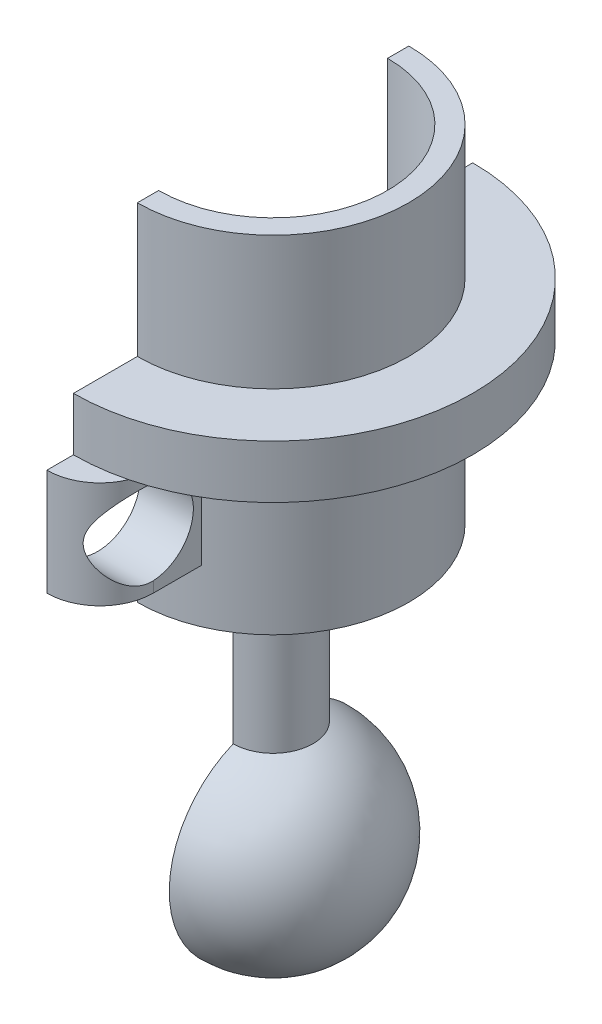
ISO-10303-21;
HEADER;
FILE_DESCRIPTION(('STEP AP214'),'2;1');
FILE_NAME('part.step','',(''),(''),'','','');
FILE_SCHEMA(('AUTOMOTIVE_DESIGN { 1 0 10303 214 1 1 1 1 }'));
ENDSEC;
DATA;
#1=APPLICATION_CONTEXT('core data for automotive mechanical design processes');
#2=APPLICATION_PROTOCOL_DEFINITION('international standard','automotive_design',2000,#1);
#3=PRODUCT_CONTEXT('',#1,'mechanical');
#4=PRODUCT('Part','Part','',(#3));
#5=PRODUCT_RELATED_PRODUCT_CATEGORY('part','',(#4));
#6=PRODUCT_DEFINITION_FORMATION('','',#4);
#7=PRODUCT_DEFINITION_CONTEXT('part definition',#1,'design');
#8=PRODUCT_DEFINITION('design','',#6,#7);
#9=PRODUCT_DEFINITION_SHAPE('','',#8);
#10=(LENGTH_UNIT() NAMED_UNIT(*) SI_UNIT(.MILLI.,.METRE.));
#11=(NAMED_UNIT(*) PLANE_ANGLE_UNIT() SI_UNIT($,.RADIAN.));
#12=(NAMED_UNIT(*) SI_UNIT($,.STERADIAN.) SOLID_ANGLE_UNIT());
#13=UNCERTAINTY_MEASURE_WITH_UNIT(LENGTH_MEASURE(1.E-05),#10,'distance_accuracy_value','');
#14=(GEOMETRIC_REPRESENTATION_CONTEXT(3) GLOBAL_UNCERTAINTY_ASSIGNED_CONTEXT((#13)) GLOBAL_UNIT_ASSIGNED_CONTEXT((#10,
#11,#12)) REPRESENTATION_CONTEXT('',''));
#15=CARTESIAN_POINT('',(0.,0.,0.));
#16=DIRECTION('',(0.,0.,1.));
#17=DIRECTION('',(1.,0.,0.));
#18=AXIS2_PLACEMENT_3D('',#15,#16,#17);
#19=CARTESIAN_POINT('',(0.,0.,0.));
#20=DIRECTION('',(1.,0.,0.));
#21=DIRECTION('',(0.,0.,-1.));
#22=AXIS2_PLACEMENT_3D('',#19,#20,#21);
#23=PLANE('',#22);
#24=DIRECTION('',(0.,0.,-1.));
#25=VECTOR('',#24,1.);
#26=CARTESIAN_POINT('',(0.,1.,0.));
#27=LINE('',#26,#25);
#28=CARTESIAN_POINT('',(0.,1.,2.5));
#29=VERTEX_POINT('',#28);
#30=CARTESIAN_POINT('',(0.,1.,-2.5));
#31=VERTEX_POINT('',#30);
#32=EDGE_CURVE('E493',#29,#31,#27,.T.);
#33=ORIENTED_EDGE('',*,*,#32,.T.);
#34=DIRECTION('',(0.,1.,0.));
#35=VECTOR('',#34,1.);
#36=CARTESIAN_POINT('',(0.,0.,-2.5));
#37=LINE('',#36,#35);
#38=CARTESIAN_POINT('',(0.,0.,-2.5));
#39=VERTEX_POINT('',#38);
#40=EDGE_CURVE('E554',#31,#39,#37,.F.);
#41=ORIENTED_EDGE('',*,*,#40,.T.);
#42=DIRECTION('',(0.,0.,-1.));
#43=VECTOR('',#42,1.);
#44=CARTESIAN_POINT('',(0.,0.,0.));
#45=LINE('',#44,#43);
#46=CARTESIAN_POINT('',(0.,0.,-1.5));
#47=VERTEX_POINT('',#46);
#48=EDGE_CURVE('E851',#47,#39,#45,.T.);
#49=ORIENTED_EDGE('',*,*,#48,.F.);
#50=DIRECTION('',(0.,1.,0.));
#51=VECTOR('',#50,1.);
#52=CARTESIAN_POINT('',(0.,0.,-1.5));
#53=LINE('',#52,#51);
#54=CARTESIAN_POINT('',(0.,-6.4,-1.5));
#55=VERTEX_POINT('',#54);
#56=EDGE_CURVE('E550',#47,#55,#53,.F.);
#57=ORIENTED_EDGE('',*,*,#56,.T.);
#58=CARTESIAN_POINT('',(0.,-10.,0.));
#59=DIRECTION('',(1.,0.,0.));
#60=DIRECTION('',(0.,0.,-1.));
#61=AXIS2_PLACEMENT_3D('',#58,#59,#60);
#62=CIRCLE('',#61,3.9);
#63=CARTESIAN_POINT('',(0.,-6.4,1.5));
#64=VERTEX_POINT('',#63);
#65=EDGE_CURVE('E530',#55,#64,#62,.F.);
#66=ORIENTED_EDGE('',*,*,#65,.T.);
#67=DIRECTION('',(0.,1.,0.));
#68=VECTOR('',#67,1.);
#69=CARTESIAN_POINT('',(0.,0.,1.5));
#70=LINE('',#69,#68);
#71=CARTESIAN_POINT('',(0.,0.,1.5));
#72=VERTEX_POINT('',#71);
#73=EDGE_CURVE('E546',#64,#72,#70,.T.);
#74=ORIENTED_EDGE('',*,*,#73,.T.);
#75=CARTESIAN_POINT('',(0.,0.,2.5));
#76=VERTEX_POINT('',#75);
#77=EDGE_CURVE('E518',#76,#72,#45,.T.);
#78=ORIENTED_EDGE('',*,*,#77,.F.);
#79=DIRECTION('',(0.,1.,0.));
#80=VECTOR('',#79,1.);
#81=CARTESIAN_POINT('',(0.,0.,2.5));
#82=LINE('',#81,#80);
#83=EDGE_CURVE('E50',#76,#29,#82,.T.);
#84=ORIENTED_EDGE('',*,*,#83,.T.);
#85=EDGE_LOOP('',(#33,#41,#49,#57,#66,#74,#78,#84));
#86=FACE_BOUND('',#85,.T.);
#87=ADVANCED_FACE('F47',(#86),#23,.F.);
#88=CARTESIAN_POINT('',(0.,4.,6.59574082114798));
#89=DIRECTION('',(1.,0.,0.));
#90=DIRECTION('',(0.,1.,0.));
#91=AXIS2_PLACEMENT_3D('',#88,#89,#90);
#92=CIRCLE('',#91,1.6);
#93=CARTESIAN_POINT('',(0.,5.6,6.59574082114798));
#94=VERTEX_POINT('',#93);
#95=EDGE_CURVE('E526',#94,#94,#92,.T.);
#96=ORIENTED_EDGE('',*,*,#95,.T.);
#97=EDGE_LOOP('',(#96));
#98=FACE_BOUND('',#97,.T.);
#99=CARTESIAN_POINT('',(0.,0.,5.1));
#100=VERTEX_POINT('',#99);
#101=CARTESIAN_POINT('',(0.,0.,3.3));
#102=VERTEX_POINT('',#101);
#103=EDGE_CURVE('E513',#100,#102,#45,.T.);
#104=ORIENTED_EDGE('',*,*,#103,.F.);
#105=DIRECTION('',(0.,-1.,0.));
#106=VECTOR('',#105,1.);
#107=CARTESIAN_POINT('',(0.,1.,5.1));
#108=LINE('',#107,#106);
#109=CARTESIAN_POINT('',(0.,2.,5.1));
#110=VERTEX_POINT('',#109);
#111=EDGE_CURVE('E538',#110,#100,#108,.T.);
#112=ORIENTED_EDGE('',*,*,#111,.F.);
#113=DIRECTION('',(0.,0.,1.));
#114=VECTOR('',#113,1.);
#115=CARTESIAN_POINT('',(0.,2.,-7.502));
#116=LINE('',#115,#114);
#117=CARTESIAN_POINT('',(0.,2.,8.5));
#118=VERTEX_POINT('',#117);
#119=EDGE_CURVE('E527',#110,#118,#116,.T.);
#120=ORIENTED_EDGE('',*,*,#119,.T.);
#121=DIRECTION('',(0.,1.,0.));
#122=VECTOR('',#121,1.);
#123=CARTESIAN_POINT('',(0.,6.,8.5));
#124=LINE('',#123,#122);
#125=CARTESIAN_POINT('',(0.,6.,8.5));
#126=VERTEX_POINT('',#125);
#127=EDGE_CURVE('E56',#118,#126,#124,.T.);
#128=ORIENTED_EDGE('',*,*,#127,.T.);
#129=DIRECTION('',(0.,0.,-1.));
#130=VECTOR('',#129,1.);
#131=CARTESIAN_POINT('',(0.,6.,-7.502));
#132=LINE('',#131,#130);
#133=CARTESIAN_POINT('',(0.,6.,7.5));
#134=VERTEX_POINT('',#133);
#135=EDGE_CURVE('E71',#126,#134,#132,.T.);
#136=ORIENTED_EDGE('',*,*,#135,.T.);
#137=DIRECTION('',(0.,-1.,0.));
#138=VECTOR('',#137,1.);
#139=CARTESIAN_POINT('',(0.,8.,7.5));
#140=LINE('',#139,#138);
#141=CARTESIAN_POINT('',(0.,8.,7.5));
#142=VERTEX_POINT('',#141);
#143=EDGE_CURVE('E523',#142,#134,#140,.T.);
#144=ORIENTED_EDGE('',*,*,#143,.F.);
#145=DIRECTION('',(0.,0.,-1.));
#146=VECTOR('',#145,1.);
#147=CARTESIAN_POINT('',(0.,8.,0.));
#148=LINE('',#147,#146);
#149=CARTESIAN_POINT('',(0.,8.,5.1));
#150=VERTEX_POINT('',#149);
#151=EDGE_CURVE('E557',#142,#150,#148,.T.);
#152=ORIENTED_EDGE('',*,*,#151,.T.);
#153=DIRECTION('',(0.,-1.,0.));
#154=VECTOR('',#153,1.);
#155=CARTESIAN_POINT('',(0.,1.,5.1));
#156=LINE('',#155,#154);
#157=CARTESIAN_POINT('',(0.,13.,5.1));
#158=VERTEX_POINT('',#157);
#159=EDGE_CURVE('E534',#158,#150,#156,.T.);
#160=ORIENTED_EDGE('',*,*,#159,.F.);
#161=DIRECTION('',(0.,0.,-1.));
#162=VECTOR('',#161,1.);
#163=CARTESIAN_POINT('',(0.,13.,0.));
#164=LINE('',#163,#162);
#165=CARTESIAN_POINT('',(0.,13.,4.3));
#166=VERTEX_POINT('',#165);
#167=EDGE_CURVE('E504',#158,#166,#164,.T.);
#168=ORIENTED_EDGE('',*,*,#167,.T.);
#169=DIRECTION('',(0.,-1.,0.));
#170=VECTOR('',#169,1.);
#171=CARTESIAN_POINT('',(0.,13.,4.3));
#172=LINE('',#171,#170);
#173=CARTESIAN_POINT('',(0.,1.,4.3));
#174=VERTEX_POINT('',#173);
#175=EDGE_CURVE('E492',#166,#174,#172,.T.);
#176=ORIENTED_EDGE('',*,*,#175,.T.);
#177=CARTESIAN_POINT('',(0.,1.,3.3));
#178=VERTEX_POINT('',#177);
#179=EDGE_CURVE('E495',#174,#178,#27,.T.);
#180=ORIENTED_EDGE('',*,*,#179,.T.);
#181=DIRECTION('',(0.,1.,0.));
#182=VECTOR('',#181,1.);
#183=CARTESIAN_POINT('',(0.,0.,3.3));
#184=LINE('',#183,#182);
#185=EDGE_CURVE('E522',#102,#178,#184,.T.);
#186=ORIENTED_EDGE('',*,*,#185,.F.);
#187=EDGE_LOOP('',(#104,#112,#120,#128,#136,#144,#152,#160,#168,#176,#180,#186));
#188=FACE_BOUND('',#187,.T.);
#189=ADVANCED_FACE('F463',(#98,#188),#23,.F.);
#190=CARTESIAN_POINT('',(0.,4.,-6.59574082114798));
#191=DIRECTION('',(-1.,0.,0.));
#192=DIRECTION('',(0.,1.,0.));
#193=AXIS2_PLACEMENT_3D('',#190,#191,#192);
#194=CIRCLE('',#193,1.6);
#195=CARTESIAN_POINT('',(0.,5.6,-6.59574082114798));
#196=VERTEX_POINT('',#195);
#197=EDGE_CURVE('E478',#196,#196,#194,.T.);
#198=ORIENTED_EDGE('',*,*,#197,.F.);
#199=EDGE_LOOP('',(#198));
#200=FACE_BOUND('',#199,.T.);
#201=CARTESIAN_POINT('',(0.,1.,-3.3));
#202=VERTEX_POINT('',#201);
#203=CARTESIAN_POINT('',(0.,1.,-4.3));
#204=VERTEX_POINT('',#203);
#205=EDGE_CURVE('E482',#202,#204,#27,.T.);
#206=ORIENTED_EDGE('',*,*,#205,.T.);
#207=DIRECTION('',(0.,-1.,0.));
#208=VECTOR('',#207,1.);
#209=CARTESIAN_POINT('',(0.,13.,-4.3));
#210=LINE('',#209,#208);
#211=CARTESIAN_POINT('',(0.,13.,-4.3));
#212=VERTEX_POINT('',#211);
#213=EDGE_CURVE('E485',#204,#212,#210,.F.);
#214=ORIENTED_EDGE('',*,*,#213,.T.);
#215=CARTESIAN_POINT('',(0.,13.,-5.1));
#216=VERTEX_POINT('',#215);
#217=EDGE_CURVE('E508',#212,#216,#164,.T.);
#218=ORIENTED_EDGE('',*,*,#217,.T.);
#219=DIRECTION('',(0.,-1.,0.));
#220=VECTOR('',#219,1.);
#221=CARTESIAN_POINT('',(0.,1.,-5.1));
#222=LINE('',#221,#220);
#223=CARTESIAN_POINT('',(0.,8.,-5.1));
#224=VERTEX_POINT('',#223);
#225=EDGE_CURVE('E537',#224,#216,#222,.F.);
#226=ORIENTED_EDGE('',*,*,#225,.F.);
#227=CARTESIAN_POINT('',(0.,8.,-7.5));
#228=VERTEX_POINT('',#227);
#229=EDGE_CURVE('E553',#224,#228,#148,.T.);
#230=ORIENTED_EDGE('',*,*,#229,.T.);
#231=DIRECTION('',(0.,-1.,0.));
#232=VECTOR('',#231,1.);
#233=CARTESIAN_POINT('',(0.,8.,-7.5));
#234=LINE('',#233,#232);
#235=CARTESIAN_POINT('',(0.,6.,-7.5));
#236=VERTEX_POINT('',#235);
#237=EDGE_CURVE('E533',#236,#228,#234,.F.);
#238=ORIENTED_EDGE('',*,*,#237,.F.);
#239=DIRECTION('',(0.,0.,1.));
#240=VECTOR('',#239,1.);
#241=CARTESIAN_POINT('',(0.,6.,8.502));
#242=LINE('',#241,#240);
#243=CARTESIAN_POINT('',(0.,6.,-8.5));
#244=VERTEX_POINT('',#243);
#245=EDGE_CURVE('E787',#244,#236,#242,.T.);
#246=ORIENTED_EDGE('',*,*,#245,.F.);
#247=DIRECTION('',(0.,1.,0.));
#248=VECTOR('',#247,1.);
#249=CARTESIAN_POINT('',(0.,0.,-8.5));
#250=LINE('',#249,#248);
#251=CARTESIAN_POINT('',(0.,2.,-8.5));
#252=VERTEX_POINT('',#251);
#253=EDGE_CURVE('E11',#244,#252,#250,.F.);
#254=ORIENTED_EDGE('',*,*,#253,.T.);
#255=DIRECTION('',(0.,0.,-1.));
#256=VECTOR('',#255,1.);
#257=CARTESIAN_POINT('',(0.,2.,8.502));
#258=LINE('',#257,#256);
#259=CARTESIAN_POINT('',(0.,2.,-5.1));
#260=VERTEX_POINT('',#259);
#261=EDGE_CURVE('E812',#260,#252,#258,.T.);
#262=ORIENTED_EDGE('',*,*,#261,.F.);
#263=DIRECTION('',(0.,-1.,0.));
#264=VECTOR('',#263,1.);
#265=CARTESIAN_POINT('',(0.,1.,-5.1));
#266=LINE('',#265,#264);
#267=CARTESIAN_POINT('',(0.,0.,-5.1));
#268=VERTEX_POINT('',#267);
#269=EDGE_CURVE('E517',#268,#260,#266,.F.);
#270=ORIENTED_EDGE('',*,*,#269,.F.);
#271=CARTESIAN_POINT('',(0.,0.,-3.3));
#272=VERTEX_POINT('',#271);
#273=EDGE_CURVE('E519',#272,#268,#45,.T.);
#274=ORIENTED_EDGE('',*,*,#273,.F.);
#275=DIRECTION('',(0.,1.,0.));
#276=VECTOR('',#275,1.);
#277=CARTESIAN_POINT('',(0.,0.,-3.3));
#278=LINE('',#277,#276);
#279=EDGE_CURVE('E488',#202,#272,#278,.F.);
#280=ORIENTED_EDGE('',*,*,#279,.F.);
#281=EDGE_LOOP('',(#206,#214,#218,#226,#230,#238,#246,#254,#262,#270,#274,#280));
#282=FACE_BOUND('',#281,.T.);
#283=ADVANCED_FACE('F415',(#200,#282),#23,.F.);
#284=CARTESIAN_POINT('',(0.,0.,0.));
#285=DIRECTION('',(0.,1.,0.));
#286=DIRECTION('',(0.,0.,1.));
#287=AXIS2_PLACEMENT_3D('',#284,#285,#286);
#288=CYLINDRICAL_SURFACE('',#287,3.3);
#289=CARTESIAN_POINT('',(0.,1.,0.));
#290=DIRECTION('',(0.,1.,0.));
#291=DIRECTION('',(0.,0.,1.));
#292=AXIS2_PLACEMENT_3D('',#289,#290,#291);
#293=CIRCLE('',#292,3.3);
#294=CARTESIAN_POINT('',(2.33345237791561,1.,2.33345237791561));
#295=VERTEX_POINT('',#294);
#296=CARTESIAN_POINT('',(3.18755522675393,1.,0.854102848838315));
#297=VERTEX_POINT('',#296);
#298=EDGE_CURVE('E665',#295,#297,#293,.T.);
#299=ORIENTED_EDGE('',*,*,#298,.T.);
#300=DIRECTION('',(0.,1.,0.));
#301=VECTOR('',#300,1.);
#302=CARTESIAN_POINT('',(3.18755522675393,0.,0.854102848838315));
#303=LINE('',#302,#301);
#304=CARTESIAN_POINT('',(3.18755522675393,0.,0.854102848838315));
#305=VERTEX_POINT('',#304);
#306=EDGE_CURVE('E674',#305,#297,#303,.T.);
#307=ORIENTED_EDGE('',*,*,#306,.F.);
#308=CARTESIAN_POINT('',(0.,0.,0.));
#309=DIRECTION('',(0.,1.,0.));
#310=DIRECTION('',(0.,0.,1.));
#311=AXIS2_PLACEMENT_3D('',#308,#309,#310);
#312=CIRCLE('',#311,3.3);
#313=CARTESIAN_POINT('',(2.33345237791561,0.,2.33345237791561));
#314=VERTEX_POINT('',#313);
#315=EDGE_CURVE('E647',#314,#305,#312,.T.);
#316=ORIENTED_EDGE('',*,*,#315,.F.);
#317=DIRECTION('',(0.,1.,0.));
#318=VECTOR('',#317,1.);
#319=CARTESIAN_POINT('',(2.33345237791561,0.,2.33345237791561));
#320=LINE('',#319,#318);
#321=EDGE_CURVE('E677',#314,#295,#320,.T.);
#322=ORIENTED_EDGE('',*,*,#321,.T.);
#323=EDGE_LOOP('',(#299,#307,#316,#322));
#324=FACE_BOUND('',#323,.T.);
#325=ADVANCED_FACE('F412',(#324),#288,.F.);
#326=CARTESIAN_POINT('',(0.,0.,0.));
#327=DIRECTION('',(0.258819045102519,0.,-0.965925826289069));
#328=DIRECTION('',(-0.965925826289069,0.,-0.258819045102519));
#329=AXIS2_PLACEMENT_3D('',#326,#327,#328);
#330=PLANE('',#329);
#331=DIRECTION('',(-0.965925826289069,0.,-0.258819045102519));
#332=VECTOR('',#331,1.);
#333=CARTESIAN_POINT('',(0.,1.,0.));
#334=LINE('',#333,#332);
#335=CARTESIAN_POINT('',(2.41481456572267,1.,0.647047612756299));
#336=VERTEX_POINT('',#335);
#337=EDGE_CURVE('E643',#297,#336,#334,.T.);
#338=ORIENTED_EDGE('',*,*,#337,.T.);
#339=DIRECTION('',(0.,1.,0.));
#340=VECTOR('',#339,1.);
#341=CARTESIAN_POINT('',(2.41481456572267,0.,0.647047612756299));
#342=LINE('',#341,#340);
#343=CARTESIAN_POINT('',(2.41481456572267,0.,0.647047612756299));
#344=VERTEX_POINT('',#343);
#345=EDGE_CURVE('E627',#344,#336,#342,.T.);
#346=ORIENTED_EDGE('',*,*,#345,.F.);
#347=DIRECTION('',(-0.965925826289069,0.,-0.258819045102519));
#348=VECTOR('',#347,1.);
#349=CARTESIAN_POINT('',(0.,0.,0.));
#350=LINE('',#349,#348);
#351=EDGE_CURVE('E651',#305,#344,#350,.T.);
#352=ORIENTED_EDGE('',*,*,#351,.F.);
#353=ORIENTED_EDGE('',*,*,#306,.T.);
#354=EDGE_LOOP('',(#338,#346,#352,#353));
#355=FACE_BOUND('',#354,.T.);
#356=ADVANCED_FACE('F407',(#355),#330,.F.);
#357=CARTESIAN_POINT('',(0.,0.,0.));
#358=DIRECTION('',(0.,1.,0.));
#359=DIRECTION('',(0.,0.,1.));
#360=AXIS2_PLACEMENT_3D('',#357,#358,#359);
#361=CYLINDRICAL_SURFACE('',#360,2.5);
#362=CARTESIAN_POINT('',(0.,1.,0.));
#363=DIRECTION('',(0.,1.,0.));
#364=DIRECTION('',(0.,0.,1.));
#365=AXIS2_PLACEMENT_3D('',#362,#363,#364);
#366=CIRCLE('',#365,2.5);
#367=CARTESIAN_POINT('',(1.76776695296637,1.,1.76776695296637));
#368=VERTEX_POINT('',#367);
#369=EDGE_CURVE('E656',#368,#336,#366,.T.);
#370=ORIENTED_EDGE('',*,*,#369,.F.);
#371=DIRECTION('',(0.,1.,0.));
#372=VECTOR('',#371,1.);
#373=CARTESIAN_POINT('',(1.76776695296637,0.,1.76776695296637));
#374=LINE('',#373,#372);
#375=CARTESIAN_POINT('',(1.76776695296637,0.,1.76776695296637));
#376=VERTEX_POINT('',#375);
#377=EDGE_CURVE('E655',#376,#368,#374,.T.);
#378=ORIENTED_EDGE('',*,*,#377,.F.);
#379=CARTESIAN_POINT('',(0.,0.,0.));
#380=DIRECTION('',(0.,1.,0.));
#381=DIRECTION('',(0.,0.,1.));
#382=AXIS2_PLACEMENT_3D('',#379,#380,#381);
#383=CIRCLE('',#382,2.5);
#384=EDGE_CURVE('E640',#376,#344,#383,.T.);
#385=ORIENTED_EDGE('',*,*,#384,.T.);
#386=ORIENTED_EDGE('',*,*,#345,.T.);
#387=EDGE_LOOP('',(#370,#378,#385,#386));
#388=FACE_BOUND('',#387,.T.);
#389=ADVANCED_FACE('F404',(#388),#361,.T.);
#390=CARTESIAN_POINT('',(0.,0.,0.));
#391=DIRECTION('',(0.707106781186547,0.,-0.707106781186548));
#392=DIRECTION('',(-0.707106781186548,0.,-0.707106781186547));
#393=AXIS2_PLACEMENT_3D('',#390,#391,#392);
#394=PLANE('',#393);
#395=DIRECTION('',(-0.707106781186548,0.,-0.707106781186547));
#396=VECTOR('',#395,1.);
#397=CARTESIAN_POINT('',(0.,1.,0.));
#398=LINE('',#397,#396);
#399=EDGE_CURVE('E661',#295,#368,#398,.T.);
#400=ORIENTED_EDGE('',*,*,#399,.F.);
#401=ORIENTED_EDGE('',*,*,#321,.F.);
#402=DIRECTION('',(-0.707106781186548,0.,-0.707106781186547));
#403=VECTOR('',#402,1.);
#404=CARTESIAN_POINT('',(0.,0.,0.));
#405=LINE('',#404,#403);
#406=EDGE_CURVE('E644',#314,#376,#405,.T.);
#407=ORIENTED_EDGE('',*,*,#406,.T.);
#408=ORIENTED_EDGE('',*,*,#377,.T.);
#409=EDGE_LOOP('',(#400,#401,#407,#408));
#410=FACE_BOUND('',#409,.T.);
#411=ADVANCED_FACE('F399',(#410),#394,.T.);
#412=CARTESIAN_POINT('',(0.,0.,0.));
#413=DIRECTION('',(0.,1.,0.));
#414=DIRECTION('',(0.,0.,1.));
#415=AXIS2_PLACEMENT_3D('',#412,#413,#414);
#416=CYLINDRICAL_SURFACE('',#415,3.3);
#417=CARTESIAN_POINT('',(0.,1.,0.));
#418=DIRECTION('',(0.,1.,0.));
#419=DIRECTION('',(0.,0.,1.));
#420=AXIS2_PLACEMENT_3D('',#417,#418,#419);
#421=CIRCLE('',#420,3.3);
#422=CARTESIAN_POINT('',(3.18755522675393,1.,-0.854102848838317));
#423=VERTEX_POINT('',#422);
#424=CARTESIAN_POINT('',(2.3334523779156,1.,-2.33345237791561));
#425=VERTEX_POINT('',#424);
#426=EDGE_CURVE('E706',#423,#425,#421,.T.);
#427=ORIENTED_EDGE('',*,*,#426,.T.);
#428=DIRECTION('',(0.,1.,0.));
#429=VECTOR('',#428,1.);
#430=CARTESIAN_POINT('',(2.3334523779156,0.,-2.33345237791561));
#431=LINE('',#430,#429);
#432=CARTESIAN_POINT('',(2.3334523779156,0.,-2.33345237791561));
#433=VERTEX_POINT('',#432);
#434=EDGE_CURVE('E715',#433,#425,#431,.T.);
#435=ORIENTED_EDGE('',*,*,#434,.F.);
#436=CARTESIAN_POINT('',(0.,0.,0.));
#437=DIRECTION('',(0.,1.,0.));
#438=DIRECTION('',(0.,0.,1.));
#439=AXIS2_PLACEMENT_3D('',#436,#437,#438);
#440=CIRCLE('',#439,3.3);
#441=CARTESIAN_POINT('',(3.18755522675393,0.,-0.854102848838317));
#442=VERTEX_POINT('',#441);
#443=EDGE_CURVE('E690',#442,#433,#440,.T.);
#444=ORIENTED_EDGE('',*,*,#443,.F.);
#445=DIRECTION('',(0.,1.,0.));
#446=VECTOR('',#445,1.);
#447=CARTESIAN_POINT('',(3.18755522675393,0.,-0.854102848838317));
#448=LINE('',#447,#446);
#449=EDGE_CURVE('E718',#442,#423,#448,.T.);
#450=ORIENTED_EDGE('',*,*,#449,.T.);
#451=EDGE_LOOP('',(#427,#435,#444,#450));
#452=FACE_BOUND('',#451,.T.);
#453=ADVANCED_FACE('F396',(#452),#416,.F.);
#454=CARTESIAN_POINT('',(0.,0.,0.));
#455=DIRECTION('',(-0.707106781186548,0.,-0.707106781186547));
#456=DIRECTION('',(-0.707106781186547,0.,0.707106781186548));
#457=AXIS2_PLACEMENT_3D('',#454,#455,#456);
#458=PLANE('',#457);
#459=DIRECTION('',(-0.707106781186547,0.,0.707106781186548));
#460=VECTOR('',#459,1.);
#461=CARTESIAN_POINT('',(0.,1.,0.));
#462=LINE('',#461,#460);
#463=CARTESIAN_POINT('',(1.76776695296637,1.,-1.76776695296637));
#464=VERTEX_POINT('',#463);
#465=EDGE_CURVE('E686',#425,#464,#462,.T.);
#466=ORIENTED_EDGE('',*,*,#465,.T.);
#467=DIRECTION('',(0.,1.,0.));
#468=VECTOR('',#467,1.);
#469=CARTESIAN_POINT('',(1.76776695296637,0.,-1.76776695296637));
#470=LINE('',#469,#468);
#471=CARTESIAN_POINT('',(1.76776695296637,0.,-1.76776695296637));
#472=VERTEX_POINT('',#471);
#473=EDGE_CURVE('E660',#472,#464,#470,.T.);
#474=ORIENTED_EDGE('',*,*,#473,.F.);
#475=DIRECTION('',(-0.707106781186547,0.,0.707106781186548));
#476=VECTOR('',#475,1.);
#477=CARTESIAN_POINT('',(0.,0.,0.));
#478=LINE('',#477,#476);
#479=EDGE_CURVE('E694',#433,#472,#478,.T.);
#480=ORIENTED_EDGE('',*,*,#479,.F.);
#481=ORIENTED_EDGE('',*,*,#434,.T.);
#482=EDGE_LOOP('',(#466,#474,#480,#481));
#483=FACE_BOUND('',#482,.T.);
#484=ADVANCED_FACE('F390',(#483),#458,.F.);
#485=CARTESIAN_POINT('',(0.,0.,0.));
#486=DIRECTION('',(0.,1.,0.));
#487=DIRECTION('',(0.,0.,1.));
#488=AXIS2_PLACEMENT_3D('',#485,#486,#487);
#489=CYLINDRICAL_SURFACE('',#488,2.5);
#490=CARTESIAN_POINT('',(0.,1.,0.));
#491=DIRECTION('',(0.,1.,0.));
#492=DIRECTION('',(0.,0.,1.));
#493=AXIS2_PLACEMENT_3D('',#490,#491,#492);
#494=CIRCLE('',#493,2.5);
#495=CARTESIAN_POINT('',(2.41481456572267,1.,-0.6470476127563));
#496=VERTEX_POINT('',#495);
#497=EDGE_CURVE('E578',#496,#464,#494,.T.);
#498=ORIENTED_EDGE('',*,*,#497,.F.);
#499=DIRECTION('',(0.,1.,0.));
#500=VECTOR('',#499,1.);
#501=CARTESIAN_POINT('',(2.41481456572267,0.,-0.647047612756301));
#502=LINE('',#501,#500);
#503=CARTESIAN_POINT('',(2.41481456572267,0.,-0.647047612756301));
#504=VERTEX_POINT('',#503);
#505=EDGE_CURVE('E698',#504,#496,#502,.T.);
#506=ORIENTED_EDGE('',*,*,#505,.F.);
#507=CARTESIAN_POINT('',(0.,0.,0.));
#508=DIRECTION('',(0.,1.,0.));
#509=DIRECTION('',(0.,0.,1.));
#510=AXIS2_PLACEMENT_3D('',#507,#508,#509);
#511=CIRCLE('',#510,2.5);
#512=EDGE_CURVE('E683',#504,#472,#511,.T.);
#513=ORIENTED_EDGE('',*,*,#512,.T.);
#514=ORIENTED_EDGE('',*,*,#473,.T.);
#515=EDGE_LOOP('',(#498,#506,#513,#514));
#516=FACE_BOUND('',#515,.T.);
#517=ADVANCED_FACE('F386',(#516),#489,.T.);
#518=CARTESIAN_POINT('',(0.,0.,0.));
#519=DIRECTION('',(-0.25881904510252,0.,-0.965925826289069));
#520=DIRECTION('',(-0.965925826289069,0.,0.25881904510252));
#521=AXIS2_PLACEMENT_3D('',#518,#519,#520);
#522=PLANE('',#521);
#523=DIRECTION('',(-0.965925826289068,0.,0.25881904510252));
#524=VECTOR('',#523,1.);
#525=CARTESIAN_POINT('',(0.,1.,0.));
#526=LINE('',#525,#524);
#527=EDGE_CURVE('E702',#423,#496,#526,.T.);
#528=ORIENTED_EDGE('',*,*,#527,.F.);
#529=ORIENTED_EDGE('',*,*,#449,.F.);
#530=DIRECTION('',(-0.965925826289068,0.,0.25881904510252));
#531=VECTOR('',#530,1.);
#532=CARTESIAN_POINT('',(0.,0.,0.));
#533=LINE('',#532,#531);
#534=EDGE_CURVE('E687',#442,#504,#533,.T.);
#535=ORIENTED_EDGE('',*,*,#534,.T.);
#536=ORIENTED_EDGE('',*,*,#505,.T.);
#537=EDGE_LOOP('',(#528,#529,#535,#536));
#538=FACE_BOUND('',#537,.T.);
#539=ADVANCED_FACE('F389',(#538),#522,.T.);
#540=CARTESIAN_POINT('',(0.,0.,0.));
#541=DIRECTION('',(0.965925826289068,0.,-0.258819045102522));
#542=DIRECTION('',(-0.258819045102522,0.,-0.965925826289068));
#543=AXIS2_PLACEMENT_3D('',#540,#541,#542);
#544=PLANE('',#543);
#545=DIRECTION('',(-0.258819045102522,0.,-0.965925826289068));
#546=VECTOR('',#545,1.);
#547=CARTESIAN_POINT('',(0.,1.,0.));
#548=LINE('',#547,#546);
#549=CARTESIAN_POINT('',(0.854102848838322,1.,3.18755522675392));
#550=VERTEX_POINT('',#549);
#551=CARTESIAN_POINT('',(0.647047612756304,1.,2.41481456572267));
#552=VERTEX_POINT('',#551);
#553=EDGE_CURVE('E615',#550,#552,#548,.T.);
#554=ORIENTED_EDGE('',*,*,#553,.T.);
#555=DIRECTION('',(0.,1.,0.));
#556=VECTOR('',#555,1.);
#557=CARTESIAN_POINT('',(0.647047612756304,0.,2.41481456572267));
#558=LINE('',#557,#556);
#559=CARTESIAN_POINT('',(0.647047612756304,0.,2.41481456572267));
#560=VERTEX_POINT('',#559);
#561=EDGE_CURVE('E597',#560,#552,#558,.T.);
#562=ORIENTED_EDGE('',*,*,#561,.F.);
#563=DIRECTION('',(-0.258819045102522,0.,-0.965925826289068));
#564=VECTOR('',#563,1.);
#565=CARTESIAN_POINT('',(0.,0.,0.));
#566=LINE('',#565,#564);
#567=CARTESIAN_POINT('',(0.854102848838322,0.,3.18755522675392));
#568=VERTEX_POINT('',#567);
#569=EDGE_CURVE('E619',#568,#560,#566,.T.);
#570=ORIENTED_EDGE('',*,*,#569,.F.);
#571=DIRECTION('',(0.,1.,0.));
#572=VECTOR('',#571,1.);
#573=CARTESIAN_POINT('',(0.854102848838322,0.,3.18755522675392));
#574=LINE('',#573,#572);
#575=EDGE_CURVE('E623',#568,#550,#574,.T.);
#576=ORIENTED_EDGE('',*,*,#575,.T.);
#577=EDGE_LOOP('',(#554,#562,#570,#576));
#578=FACE_BOUND('',#577,.T.);
#579=ADVANCED_FACE('F394',(#578),#544,.F.);
#580=CARTESIAN_POINT('',(0.854102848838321,0.,-3.18755522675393));
#581=DIRECTION('',(-0.965925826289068,0.,-0.258819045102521));
#582=DIRECTION('',(-0.258819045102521,0.,0.965925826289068));
#583=AXIS2_PLACEMENT_3D('',#580,#581,#582);
#584=PLANE('',#583);
#585=DIRECTION('',(-0.258819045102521,0.,0.965925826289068));
#586=VECTOR('',#585,1.);
#587=CARTESIAN_POINT('',(0.854102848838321,1.,-3.18755522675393));
#588=LINE('',#587,#586);
#589=CARTESIAN_POINT('',(0.854102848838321,1.,-3.18755522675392));
#590=VERTEX_POINT('',#589);
#591=CARTESIAN_POINT('',(0.647047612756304,1.,-2.41481456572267));
#592=VERTEX_POINT('',#591);
#593=EDGE_CURVE('E593',#590,#592,#588,.T.);
#594=ORIENTED_EDGE('',*,*,#593,.F.);
#595=DIRECTION('',(0.,1.,0.));
#596=VECTOR('',#595,1.);
#597=CARTESIAN_POINT('',(0.854102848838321,0.,-3.18755522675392));
#598=LINE('',#597,#596);
#599=CARTESIAN_POINT('',(0.854102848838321,0.,-3.18755522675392));
#600=VERTEX_POINT('',#599);
#601=EDGE_CURVE('E592',#600,#590,#598,.T.);
#602=ORIENTED_EDGE('',*,*,#601,.F.);
#603=DIRECTION('',(-0.258819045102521,0.,0.965925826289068));
#604=VECTOR('',#603,1.);
#605=CARTESIAN_POINT('',(0.854102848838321,0.,-3.18755522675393));
#606=LINE('',#605,#604);
#607=CARTESIAN_POINT('',(0.647047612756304,0.,-2.41481456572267));
#608=VERTEX_POINT('',#607);
#609=EDGE_CURVE('E581',#600,#608,#606,.T.);
#610=ORIENTED_EDGE('',*,*,#609,.T.);
#611=DIRECTION('',(0.,1.,0.));
#612=VECTOR('',#611,1.);
#613=CARTESIAN_POINT('',(0.647047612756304,0.,-2.41481456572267));
#614=LINE('',#613,#612);
#615=EDGE_CURVE('E607',#608,#592,#614,.T.);
#616=ORIENTED_EDGE('',*,*,#615,.T.);
#617=EDGE_LOOP('',(#594,#602,#610,#616));
#618=FACE_BOUND('',#617,.T.);
#619=ADVANCED_FACE('F432',(#618),#584,.T.);
#620=CARTESIAN_POINT('',(0.,0.,0.));
#621=DIRECTION('',(0.,1.,0.));
#622=DIRECTION('',(0.,0.,1.));
#623=AXIS2_PLACEMENT_3D('',#620,#621,#622);
#624=PLANE('',#623);
#625=ORIENTED_EDGE('',*,*,#384,.F.);
#626=ORIENTED_EDGE('',*,*,#406,.F.);
#627=ORIENTED_EDGE('',*,*,#315,.T.);
#628=ORIENTED_EDGE('',*,*,#351,.T.);
#629=EDGE_LOOP('',(#625,#626,#627,#628));
#630=FACE_BOUND('',#629,.T.);
#631=ORIENTED_EDGE('',*,*,#512,.F.);
#632=ORIENTED_EDGE('',*,*,#534,.F.);
#633=ORIENTED_EDGE('',*,*,#443,.T.);
#634=ORIENTED_EDGE('',*,*,#479,.T.);
#635=EDGE_LOOP('',(#631,#632,#633,#634));
#636=FACE_BOUND('',#635,.T.);
#637=CARTESIAN_POINT('',(0.,0.,0.));
#638=DIRECTION('',(0.,1.,0.));
#639=DIRECTION('',(0.,0.,1.));
#640=AXIS2_PLACEMENT_3D('',#637,#638,#639);
#641=CIRCLE('',#640,5.1);
#642=EDGE_CURVE('E319',#100,#268,#641,.T.);
#643=ORIENTED_EDGE('',*,*,#642,.F.);
#644=ORIENTED_EDGE('',*,*,#103,.T.);
#645=CARTESIAN_POINT('',(0.,0.,0.));
#646=DIRECTION('',(0.,1.,0.));
#647=DIRECTION('',(0.,0.,1.));
#648=AXIS2_PLACEMENT_3D('',#645,#646,#647);
#649=CIRCLE('',#648,3.3);
#650=EDGE_CURVE('E616',#102,#568,#649,.T.);
#651=ORIENTED_EDGE('',*,*,#650,.T.);
#652=ORIENTED_EDGE('',*,*,#569,.T.);
#653=CARTESIAN_POINT('',(0.,0.,0.));
#654=DIRECTION('',(0.,1.,0.));
#655=DIRECTION('',(0.,0.,1.));
#656=AXIS2_PLACEMENT_3D('',#653,#654,#655);
#657=CIRCLE('',#656,2.5);
#658=EDGE_CURVE('E612',#76,#560,#657,.T.);
#659=ORIENTED_EDGE('',*,*,#658,.F.);
#660=ORIENTED_EDGE('',*,*,#77,.T.);
#661=CARTESIAN_POINT('',(0.,0.,0.));
#662=DIRECTION('',(0.,1.,0.));
#663=DIRECTION('',(0.,0.,1.));
#664=AXIS2_PLACEMENT_3D('',#661,#662,#663);
#665=CIRCLE('',#664,1.5);
#666=EDGE_CURVE('E735',#72,#47,#665,.T.);
#667=ORIENTED_EDGE('',*,*,#666,.T.);
#668=ORIENTED_EDGE('',*,*,#48,.T.);
#669=CARTESIAN_POINT('',(0.,0.,0.));
#670=DIRECTION('',(0.,1.,0.));
#671=DIRECTION('',(0.,0.,1.));
#672=AXIS2_PLACEMENT_3D('',#669,#670,#671);
#673=CIRCLE('',#672,2.5);
#674=EDGE_CURVE('E585',#608,#39,#673,.T.);
#675=ORIENTED_EDGE('',*,*,#674,.F.);
#676=ORIENTED_EDGE('',*,*,#609,.F.);
#677=CARTESIAN_POINT('',(0.,0.,0.));
#678=DIRECTION('',(0.,1.,0.));
#679=DIRECTION('',(0.,0.,1.));
#680=AXIS2_PLACEMENT_3D('',#677,#678,#679);
#681=CIRCLE('',#680,3.3);
#682=EDGE_CURVE('E588',#600,#272,#681,.T.);
#683=ORIENTED_EDGE('',*,*,#682,.T.);
#684=ORIENTED_EDGE('',*,*,#273,.T.);
#685=EDGE_LOOP('',(#643,#644,#651,#652,#659,#660,#667,#668,#675,#676,#683,#684));
#686=FACE_BOUND('',#685,.T.);
#687=ADVANCED_FACE('F372',(#630,#636,#686),#624,.F.);
#688=CARTESIAN_POINT('',(0.,0.,0.));
#689=DIRECTION('',(0.,1.,0.));
#690=DIRECTION('',(0.,0.,1.));
#691=AXIS2_PLACEMENT_3D('',#688,#689,#690);
#692=CYLINDRICAL_SURFACE('',#691,1.5);
#693=ORIENTED_EDGE('',*,*,#56,.F.);
#694=ORIENTED_EDGE('',*,*,#666,.F.);
#695=ORIENTED_EDGE('',*,*,#73,.F.);
#696=CARTESIAN_POINT('',(0.,-6.4,0.));
#697=DIRECTION('',(0.,1.,0.));
#698=DIRECTION('',(0.,0.,1.));
#699=AXIS2_PLACEMENT_3D('',#696,#697,#698);
#700=CIRCLE('',#699,1.5);
#701=EDGE_CURVE('E739',#64,#55,#700,.T.);
#702=ORIENTED_EDGE('',*,*,#701,.T.);
#703=EDGE_LOOP('',(#693,#694,#695,#702));
#704=FACE_BOUND('',#703,.T.);
#705=ADVANCED_FACE('F368',(#704),#692,.T.);
#706=CARTESIAN_POINT('',(0.,-10.,0.));
#707=DIRECTION('',(0.,1.,0.));
#708=DIRECTION('',(0.,0.,1.));
#709=AXIS2_PLACEMENT_3D('',#706,#707,#708);
#710=SPHERICAL_SURFACE('',#709,3.9);
#711=ORIENTED_EDGE('',*,*,#65,.F.);
#712=ORIENTED_EDGE('',*,*,#701,.F.);
#713=EDGE_LOOP('',(#711,#712));
#714=FACE_BOUND('',#713,.T.);
#715=ADVANCED_FACE('F364',(#714),#710,.T.);
#716=CARTESIAN_POINT('',(0.,1.,0.));
#717=DIRECTION('',(0.,1.,0.));
#718=DIRECTION('',(0.,0.,1.));
#719=AXIS2_PLACEMENT_3D('',#716,#717,#718);
#720=PLANE('',#719);
#721=ORIENTED_EDGE('',*,*,#179,.F.);
#722=CARTESIAN_POINT('',(0.,1.,0.));
#723=DIRECTION('',(0.,1.,0.));
#724=DIRECTION('',(0.,0.,1.));
#725=AXIS2_PLACEMENT_3D('',#722,#723,#724);
#726=CIRCLE('',#725,4.3);
#727=EDGE_CURVE('E311',#204,#174,#726,.F.);
#728=ORIENTED_EDGE('',*,*,#727,.F.);
#729=ORIENTED_EDGE('',*,*,#205,.F.);
#730=CARTESIAN_POINT('',(0.,1.,0.));
#731=DIRECTION('',(0.,1.,0.));
#732=DIRECTION('',(0.,0.,1.));
#733=AXIS2_PLACEMENT_3D('',#730,#731,#732);
#734=CIRCLE('',#733,3.3);
#735=EDGE_CURVE('E584',#590,#202,#734,.T.);
#736=ORIENTED_EDGE('',*,*,#735,.F.);
#737=ORIENTED_EDGE('',*,*,#593,.T.);
#738=CARTESIAN_POINT('',(0.,1.,0.));
#739=DIRECTION('',(0.,1.,0.));
#740=DIRECTION('',(0.,0.,1.));
#741=AXIS2_PLACEMENT_3D('',#738,#739,#740);
#742=CIRCLE('',#741,2.5);
#743=EDGE_CURVE('E598',#592,#31,#742,.T.);
#744=ORIENTED_EDGE('',*,*,#743,.T.);
#745=ORIENTED_EDGE('',*,*,#32,.F.);
#746=CARTESIAN_POINT('',(0.,1.,0.));
#747=DIRECTION('',(0.,1.,0.));
#748=DIRECTION('',(0.,0.,1.));
#749=AXIS2_PLACEMENT_3D('',#746,#747,#748);
#750=CIRCLE('',#749,2.5);
#751=EDGE_CURVE('E624',#29,#552,#750,.T.);
#752=ORIENTED_EDGE('',*,*,#751,.T.);
#753=ORIENTED_EDGE('',*,*,#553,.F.);
#754=CARTESIAN_POINT('',(0.,1.,0.));
#755=DIRECTION('',(0.,1.,0.));
#756=DIRECTION('',(0.,0.,1.));
#757=AXIS2_PLACEMENT_3D('',#754,#755,#756);
#758=CIRCLE('',#757,3.3);
#759=EDGE_CURVE('E628',#178,#550,#758,.T.);
#760=ORIENTED_EDGE('',*,*,#759,.F.);
#761=EDGE_LOOP('',(#721,#728,#729,#736,#737,#744,#745,#752,#753,#760));
#762=FACE_BOUND('',#761,.T.);
#763=ORIENTED_EDGE('',*,*,#527,.T.);
#764=ORIENTED_EDGE('',*,*,#497,.T.);
#765=ORIENTED_EDGE('',*,*,#465,.F.);
#766=ORIENTED_EDGE('',*,*,#426,.F.);
#767=EDGE_LOOP('',(#763,#764,#765,#766));
#768=FACE_BOUND('',#767,.T.);
#769=ORIENTED_EDGE('',*,*,#399,.T.);
#770=ORIENTED_EDGE('',*,*,#369,.T.);
#771=ORIENTED_EDGE('',*,*,#337,.F.);
#772=ORIENTED_EDGE('',*,*,#298,.F.);
#773=EDGE_LOOP('',(#769,#770,#771,#772));
#774=FACE_BOUND('',#773,.T.);
#775=ADVANCED_FACE('F367',(#762,#768,#774),#720,.T.);
#776=CARTESIAN_POINT('',(0.,0.,0.));
#777=DIRECTION('',(0.,1.,0.));
#778=DIRECTION('',(0.,0.,1.));
#779=AXIS2_PLACEMENT_3D('',#776,#777,#778);
#780=CYLINDRICAL_SURFACE('',#779,3.3);
#781=ORIENTED_EDGE('',*,*,#735,.T.);
#782=ORIENTED_EDGE('',*,*,#279,.T.);
#783=ORIENTED_EDGE('',*,*,#682,.F.);
#784=ORIENTED_EDGE('',*,*,#601,.T.);
#785=EDGE_LOOP('',(#781,#782,#783,#784));
#786=FACE_BOUND('',#785,.T.);
#787=ADVANCED_FACE('F439',(#786),#780,.F.);
#788=CARTESIAN_POINT('',(0.,0.,0.));
#789=DIRECTION('',(0.,1.,0.));
#790=DIRECTION('',(0.,0.,1.));
#791=AXIS2_PLACEMENT_3D('',#788,#789,#790);
#792=CYLINDRICAL_SURFACE('',#791,2.5);
#793=ORIENTED_EDGE('',*,*,#40,.F.);
#794=ORIENTED_EDGE('',*,*,#743,.F.);
#795=ORIENTED_EDGE('',*,*,#615,.F.);
#796=ORIENTED_EDGE('',*,*,#674,.T.);
#797=EDGE_LOOP('',(#793,#794,#795,#796));
#798=FACE_BOUND('',#797,.T.);
#799=ADVANCED_FACE('F428',(#798),#792,.T.);
#800=CARTESIAN_POINT('',(0.,0.,0.));
#801=DIRECTION('',(0.,1.,0.));
#802=DIRECTION('',(0.,0.,1.));
#803=AXIS2_PLACEMENT_3D('',#800,#801,#802);
#804=CYLINDRICAL_SURFACE('',#803,3.3);
#805=ORIENTED_EDGE('',*,*,#650,.F.);
#806=ORIENTED_EDGE('',*,*,#185,.T.);
#807=ORIENTED_EDGE('',*,*,#759,.T.);
#808=ORIENTED_EDGE('',*,*,#575,.F.);
#809=EDGE_LOOP('',(#805,#806,#807,#808));
#810=FACE_BOUND('',#809,.T.);
#811=ADVANCED_FACE('F424',(#810),#804,.F.);
#812=CARTESIAN_POINT('',(0.,0.,0.));
#813=DIRECTION('',(0.,1.,0.));
#814=DIRECTION('',(0.,0.,1.));
#815=AXIS2_PLACEMENT_3D('',#812,#813,#814);
#816=CYLINDRICAL_SURFACE('',#815,2.5);
#817=ORIENTED_EDGE('',*,*,#83,.F.);
#818=ORIENTED_EDGE('',*,*,#658,.T.);
#819=ORIENTED_EDGE('',*,*,#561,.T.);
#820=ORIENTED_EDGE('',*,*,#751,.F.);
#821=EDGE_LOOP('',(#817,#818,#819,#820));
#822=FACE_BOUND('',#821,.T.);
#823=ADVANCED_FACE('F420',(#822),#816,.T.);
#824=CARTESIAN_POINT('',(0.,13.,0.));
#825=DIRECTION('',(0.,-1.,0.));
#826=DIRECTION('',(0.,0.,-1.));
#827=AXIS2_PLACEMENT_3D('',#824,#825,#826);
#828=CYLINDRICAL_SURFACE('',#827,4.3);
#829=ORIENTED_EDGE('',*,*,#175,.F.);
#830=CARTESIAN_POINT('',(0.,13.,0.));
#831=DIRECTION('',(0.,1.,0.));
#832=DIRECTION('',(0.,0.,1.));
#833=AXIS2_PLACEMENT_3D('',#830,#831,#832);
#834=CIRCLE('',#833,4.3);
#835=EDGE_CURVE('E502',#166,#212,#834,.T.);
#836=ORIENTED_EDGE('',*,*,#835,.T.);
#837=ORIENTED_EDGE('',*,*,#213,.F.);
#838=ORIENTED_EDGE('',*,*,#727,.T.);
#839=EDGE_LOOP('',(#829,#836,#837,#838));
#840=FACE_BOUND('',#839,.T.);
#841=ADVANCED_FACE('F423',(#840),#828,.F.);
#842=CARTESIAN_POINT('',(0.,1.,0.));
#843=DIRECTION('',(0.,-1.,0.));
#844=DIRECTION('',(0.,0.,-1.));
#845=AXIS2_PLACEMENT_3D('',#842,#843,#844);
#846=CYLINDRICAL_SURFACE('',#845,5.1);
#847=CARTESIAN_POINT('',(0.,13.,0.));
#848=DIRECTION('',(0.,1.,0.));
#849=DIRECTION('',(0.,0.,1.));
#850=AXIS2_PLACEMENT_3D('',#847,#848,#849);
#851=CIRCLE('',#850,5.1);
#852=EDGE_CURVE('E571',#158,#216,#851,.T.);
#853=ORIENTED_EDGE('',*,*,#852,.F.);
#854=ORIENTED_EDGE('',*,*,#159,.T.);
#855=CARTESIAN_POINT('',(0.,8.,0.));
#856=DIRECTION('',(0.,1.,0.));
#857=DIRECTION('',(0.,0.,1.));
#858=AXIS2_PLACEMENT_3D('',#855,#856,#857);
#859=CIRCLE('',#858,5.1);
#860=EDGE_CURVE('E732',#150,#224,#859,.T.);
#861=ORIENTED_EDGE('',*,*,#860,.T.);
#862=ORIENTED_EDGE('',*,*,#225,.T.);
#863=EDGE_LOOP('',(#853,#854,#861,#862));
#864=FACE_BOUND('',#863,.T.);
#865=ADVANCED_FACE('F376',(#864),#846,.T.);
#866=CARTESIAN_POINT('',(0.,8.,0.));
#867=DIRECTION('',(0.,1.,0.));
#868=DIRECTION('',(0.,0.,1.));
#869=AXIS2_PLACEMENT_3D('',#866,#867,#868);
#870=PLANE('',#869);
#871=ORIENTED_EDGE('',*,*,#151,.F.);
#872=CARTESIAN_POINT('',(0.,8.,0.));
#873=DIRECTION('',(0.,1.,0.));
#874=DIRECTION('',(0.,0.,1.));
#875=AXIS2_PLACEMENT_3D('',#872,#873,#874);
#876=CIRCLE('',#875,7.5);
#877=EDGE_CURVE('E611',#142,#228,#876,.T.);
#878=ORIENTED_EDGE('',*,*,#877,.T.);
#879=ORIENTED_EDGE('',*,*,#229,.F.);
#880=ORIENTED_EDGE('',*,*,#860,.F.);
#881=EDGE_LOOP('',(#871,#878,#879,#880));
#882=FACE_BOUND('',#881,.T.);
#883=ADVANCED_FACE('F351',(#882),#870,.T.);
#884=CARTESIAN_POINT('',(0.,4.,6.59574082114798));
#885=DIRECTION('',(1.,0.,0.));
#886=DIRECTION('',(0.,1.,0.));
#887=AXIS2_PLACEMENT_3D('',#884,#885,#886);
#888=CYLINDRICAL_SURFACE('',#887,1.6);
#889=ORIENTED_EDGE('',*,*,#95,.F.);
#890=EDGE_LOOP('',(#889));
#891=FACE_BOUND('',#890,.T.);
#892=CARTESIAN_POINT('',(2.,4.,6.59574082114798));
#893=DIRECTION('',(1.,0.,0.));
#894=DIRECTION('',(0.,1.,0.));
#895=AXIS2_PLACEMENT_3D('',#892,#893,#894);
#896=CIRCLE('',#895,1.6);
#897=CARTESIAN_POINT('',(2.,2.40286703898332,6.5));
#898=VERTEX_POINT('',#897);
#899=CARTESIAN_POINT('',(2.,5.59713296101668,6.5));
#900=VERTEX_POINT('',#899);
#901=EDGE_CURVE('E292',#898,#900,#896,.T.);
#902=ORIENTED_EDGE('',*,*,#901,.T.);
#903=CARTESIAN_POINT('',(2.,5.59713296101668,6.5));
#904=CARTESIAN_POINT('',(2.0000088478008,5.59942489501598,6.5380940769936));
#905=CARTESIAN_POINT('',(1.99891188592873,5.60033720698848,6.57626626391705));
#906=CARTESIAN_POINT('',(1.99454483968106,5.59944635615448,6.65243308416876));
#907=CARTESIAN_POINT('',(1.99127599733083,5.59764474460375,6.69042780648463));
#908=CARTESIAN_POINT('',(1.98263505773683,5.59139507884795,6.7656763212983));
#909=CARTESIAN_POINT('',(1.97727838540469,5.5869663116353,6.80293348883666));
#910=CARTESIAN_POINT('',(1.96456037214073,5.5755807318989,6.87670406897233));
#911=CARTESIAN_POINT('',(1.95719885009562,5.56862369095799,6.91321741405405));
#912=CARTESIAN_POINT('',(1.93231903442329,5.54417288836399,7.02111985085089));
#913=CARTESIAN_POINT('',(1.91197960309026,5.52308034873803,7.09108845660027));
#914=CARTESIAN_POINT('',(1.86505532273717,5.47251979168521,7.22572863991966));
#915=CARTESIAN_POINT('',(1.83845903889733,5.44303641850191,7.29039022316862));
#916=CARTESIAN_POINT('',(1.77029516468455,5.36539577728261,7.43513921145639));
#917=CARTESIAN_POINT('',(1.72674309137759,5.31431298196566,7.51272572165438));
#918=CARTESIAN_POINT('',(1.63419230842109,5.20160224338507,7.65617107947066));
#919=CARTESIAN_POINT('',(1.58518240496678,5.13995248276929,7.72200507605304));
#920=CARTESIAN_POINT('',(1.48419705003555,5.00637078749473,7.84293382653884));
#921=CARTESIAN_POINT('',(1.43218376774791,4.93427151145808,7.89781029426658));
#922=CARTESIAN_POINT('',(1.33016941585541,4.78090765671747,7.99518210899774));
#923=CARTESIAN_POINT('',(1.28016519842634,4.6996582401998,8.03769753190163));
#924=CARTESIAN_POINT('',(1.20752849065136,4.56228067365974,8.09470056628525));
#925=CARTESIAN_POINT('',(1.18206315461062,4.50946157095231,8.11354080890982));
#926=CARTESIAN_POINT('',(1.13646466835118,4.40003284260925,8.1459727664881));
#927=CARTESIAN_POINT('',(1.11632160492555,4.3434305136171,8.15957426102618));
#928=CARTESIAN_POINT('',(1.08709789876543,4.23707084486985,8.17883123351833));
#929=CARTESIAN_POINT('',(1.0766924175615,4.18786806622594,8.18546532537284));
#930=CARTESIAN_POINT('',(1.06306867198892,4.08810214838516,8.19409418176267));
#931=CARTESIAN_POINT('',(1.05983830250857,4.03754144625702,8.19609676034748));
#932=CARTESIAN_POINT('',(1.06114423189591,3.9364912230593,8.19527952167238));
#933=CARTESIAN_POINT('',(1.06569191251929,3.88600191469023,8.19245263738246));
#934=CARTESIAN_POINT('',(1.08174292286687,3.78659456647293,8.18223603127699));
#935=CARTESIAN_POINT('',(1.09325894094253,3.73767956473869,8.17483798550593));
#936=CARTESIAN_POINT('',(1.12830394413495,3.61964513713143,8.15152877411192));
#937=CARTESIAN_POINT('',(1.1549399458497,3.55194466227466,8.13324421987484));
#938=CARTESIAN_POINT('',(1.21474028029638,3.42198271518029,8.08927275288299));
#939=CARTESIAN_POINT('',(1.24792875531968,3.35974262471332,8.06355829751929));
#940=CARTESIAN_POINT('',(1.30956153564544,3.25387164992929,8.01204633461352));
#941=CARTESIAN_POINT('',(1.33738292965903,3.20921402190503,7.98758094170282));
#942=CARTESIAN_POINT('',(1.39386440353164,3.12279020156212,7.93479617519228));
#943=CARTESIAN_POINT('',(1.42252490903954,3.08102551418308,7.90647481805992));
#944=CARTESIAN_POINT('',(1.50846358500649,2.96004252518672,7.81584209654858));
#945=CARTESIAN_POINT('',(1.56578572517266,2.88499590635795,7.74779362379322));
#946=CARTESIAN_POINT('',(1.66532605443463,2.75989844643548,7.61021129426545));
#947=CARTESIAN_POINT('',(1.7084027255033,2.707780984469,7.54316357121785));
#948=CARTESIAN_POINT('',(1.78841617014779,2.61362237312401,7.3990665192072));
#949=CARTESIAN_POINT('',(1.82536342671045,2.57156396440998,7.32203467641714));
#950=CARTESIAN_POINT('',(1.88421729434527,2.50655137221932,7.17438844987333));
#951=CARTESIAN_POINT('',(1.90764678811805,2.4814888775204,7.1053126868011));
#952=CARTESIAN_POINT('',(1.94719815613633,2.44083540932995,6.96247499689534));
#953=CARTESIAN_POINT('',(1.96333285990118,2.42522779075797,6.88872155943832));
#954=CARTESIAN_POINT('',(1.98342784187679,2.40783096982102,6.7621638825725));
#955=CARTESIAN_POINT('',(1.98962227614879,2.40323727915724,6.71008109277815));
#956=CARTESIAN_POINT('',(1.99792572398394,2.39916195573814,6.60529338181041));
#957=CARTESIAN_POINT('',(2.00002675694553,2.39969029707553,6.5525874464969));
#958=CARTESIAN_POINT('',(2.,2.40286703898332,6.5));
#959=B_SPLINE_CURVE_WITH_KNOTS('',3,(#903,#904,#905,#906,#907,#908,#909,#910,#911,#912,#913,
#914,#915,#916,#917,#918,#919,#920,#921,#922,#923,#924,#925,#926,#927,#928,#929,#930,#931,#932,
#933,#934,#935,#936,#937,#938,#939,#940,#941,#942,#943,#944,#945,#946,#947,#948,#949,#950,#951,
#952,#953,#954,#955,#956,#957,#958),.UNSPECIFIED.,.F.,.F.,(4,2,2,2,2,2,2,2,2,2,2,2,2,2,2,2,2,2,
2,2,2,2,2,2,2,2,2,4),(0.,0.114440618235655,0.228815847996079,0.342361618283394,
0.455917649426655,0.682379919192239,0.909259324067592,1.21538574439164,1.52215200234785,
1.83452533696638,2.14638846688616,2.33075872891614,2.51478312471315,2.66633545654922,
2.81763191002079,2.96914994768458,3.1209447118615,3.34472394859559,3.56934361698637,
3.74320013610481,3.91714642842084,4.2645113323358,4.54916372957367,4.8333241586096,
5.06377994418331,5.29382882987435,5.45139192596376,5.60926190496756),.UNSPECIFIED.);
#960=EDGE_CURVE('E331',#900,#898,#959,.T.);
#961=ORIENTED_EDGE('',*,*,#960,.T.);
#962=EDGE_LOOP('',(#902,#961));
#963=FACE_BOUND('',#962,.T.);
#964=ADVANCED_FACE('F345',(#891,#963),#888,.F.);
#965=CARTESIAN_POINT('',(2.,2.,-7.502));
#966=DIRECTION('',(1.,0.,0.));
#967=DIRECTION('',(0.,1.,0.));
#968=AXIS2_PLACEMENT_3D('',#965,#966,#967);
#969=PLANE('',#968);
#970=DIRECTION('',(0.,0.,1.));
#971=VECTOR('',#970,1.);
#972=CARTESIAN_POINT('',(2.,6.,-7.502));
#973=LINE('',#972,#971);
#974=CARTESIAN_POINT('',(2.,6.,4.69148164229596));
#975=VERTEX_POINT('',#974);
#976=CARTESIAN_POINT('',(2.,6.,6.5));
#977=VERTEX_POINT('',#976);
#978=EDGE_CURVE('E308',#975,#977,#973,.T.);
#979=ORIENTED_EDGE('',*,*,#978,.T.);
#980=DIRECTION('',(0.,1.,0.));
#981=VECTOR('',#980,1.);
#982=CARTESIAN_POINT('',(2.,2.,6.5));
#983=LINE('',#982,#981);
#984=EDGE_CURVE('E328',#977,#900,#983,.F.);
#985=ORIENTED_EDGE('',*,*,#984,.T.);
#986=ORIENTED_EDGE('',*,*,#901,.F.);
#987=DIRECTION('',(0.,1.,0.));
#988=VECTOR('',#987,1.);
#989=CARTESIAN_POINT('',(2.,2.,6.5));
#990=LINE('',#989,#988);
#991=CARTESIAN_POINT('',(2.,2.,6.5));
#992=VERTEX_POINT('',#991);
#993=EDGE_CURVE('E325',#898,#992,#990,.F.);
#994=ORIENTED_EDGE('',*,*,#993,.T.);
#995=DIRECTION('',(0.,0.,1.));
#996=VECTOR('',#995,1.);
#997=CARTESIAN_POINT('',(2.,2.,-7.502));
#998=LINE('',#997,#996);
#999=CARTESIAN_POINT('',(2.,2.,4.69148164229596));
#1000=VERTEX_POINT('',#999);
#1001=EDGE_CURVE('E743',#1000,#992,#998,.T.);
#1002=ORIENTED_EDGE('',*,*,#1001,.F.);
#1003=DIRECTION('',(0.,-1.,0.));
#1004=VECTOR('',#1003,1.);
#1005=CARTESIAN_POINT('',(2.,1.,4.69148164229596));
#1006=LINE('',#1005,#1004);
#1007=EDGE_CURVE('E747',#1000,#975,#1006,.F.);
#1008=ORIENTED_EDGE('',*,*,#1007,.T.);
#1009=EDGE_LOOP('',(#979,#985,#986,#994,#1002,#1008));
#1010=FACE_BOUND('',#1009,.T.);
#1011=ADVANCED_FACE('F350',(#1010),#969,.T.);
#1012=CARTESIAN_POINT('',(-2.,2.,-7.502));
#1013=DIRECTION('',(0.,-1.,0.));
#1014=DIRECTION('',(0.,0.,-1.));
#1015=AXIS2_PLACEMENT_3D('',#1012,#1013,#1014);
#1016=PLANE('',#1015);
#1017=ORIENTED_EDGE('',*,*,#119,.F.);
#1018=CARTESIAN_POINT('',(0.,2.,0.));
#1019=DIRECTION('',(0.,-1.,0.));
#1020=DIRECTION('',(0.,0.,-1.));
#1021=AXIS2_PLACEMENT_3D('',#1018,#1019,#1020);
#1022=CIRCLE('',#1021,5.1);
#1023=EDGE_CURVE('E744',#110,#1000,#1022,.F.);
#1024=ORIENTED_EDGE('',*,*,#1023,.T.);
#1025=ORIENTED_EDGE('',*,*,#1001,.T.);
#1026=CARTESIAN_POINT('',(0.,2.,6.5));
#1027=DIRECTION('',(0.,-1.,0.));
#1028=DIRECTION('',(0.,0.,-1.));
#1029=AXIS2_PLACEMENT_3D('',#1026,#1027,#1028);
#1030=CIRCLE('',#1029,2.);
#1031=EDGE_CURVE('E310',#992,#118,#1030,.T.);
#1032=ORIENTED_EDGE('',*,*,#1031,.T.);
#1033=EDGE_LOOP('',(#1017,#1024,#1025,#1032));
#1034=FACE_BOUND('',#1033,.T.);
#1035=ADVANCED_FACE('F357',(#1034),#1016,.T.);
#1036=CARTESIAN_POINT('',(-2.,6.,-7.502));
#1037=DIRECTION('',(0.,1.,0.));
#1038=DIRECTION('',(0.,0.,1.));
#1039=AXIS2_PLACEMENT_3D('',#1036,#1037,#1038);
#1040=PLANE('',#1039);
#1041=ORIENTED_EDGE('',*,*,#135,.F.);
#1042=CARTESIAN_POINT('',(0.,6.,6.5));
#1043=DIRECTION('',(0.,1.,0.));
#1044=DIRECTION('',(0.,0.,1.));
#1045=AXIS2_PLACEMENT_3D('',#1042,#1043,#1044);
#1046=CIRCLE('',#1045,2.);
#1047=CARTESIAN_POINT('',(1.84615384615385,6.,7.26923076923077));
#1048=VERTEX_POINT('',#1047);
#1049=EDGE_CURVE('E316',#126,#1048,#1046,.T.);
#1050=ORIENTED_EDGE('',*,*,#1049,.T.);
#1051=CARTESIAN_POINT('',(0.,6.,0.));
#1052=DIRECTION('',(0.,1.,0.));
#1053=DIRECTION('',(0.,0.,1.));
#1054=AXIS2_PLACEMENT_3D('',#1051,#1052,#1053);
#1055=CIRCLE('',#1054,7.5);
#1056=EDGE_CURVE('E728',#134,#1048,#1055,.T.);
#1057=ORIENTED_EDGE('',*,*,#1056,.F.);
#1058=EDGE_LOOP('',(#1041,#1050,#1057));
#1059=FACE_BOUND('',#1058,.T.);
#1060=ADVANCED_FACE('F354',(#1059),#1040,.T.);
#1061=ORIENTED_EDGE('',*,*,#1023,.F.);
#1062=ORIENTED_EDGE('',*,*,#111,.T.);
#1063=ORIENTED_EDGE('',*,*,#642,.T.);
#1064=ORIENTED_EDGE('',*,*,#269,.T.);
#1065=CARTESIAN_POINT('',(0.,2.,0.));
#1066=DIRECTION('',(0.,1.,0.));
#1067=DIRECTION('',(0.,0.,1.));
#1068=AXIS2_PLACEMENT_3D('',#1065,#1066,#1067);
#1069=CIRCLE('',#1068,5.1);
#1070=CARTESIAN_POINT('',(2.,2.,-4.69148164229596));
#1071=VERTEX_POINT('',#1070);
#1072=EDGE_CURVE('E302',#260,#1071,#1069,.F.);
#1073=ORIENTED_EDGE('',*,*,#1072,.T.);
#1074=DIRECTION('',(0.,-1.,0.));
#1075=VECTOR('',#1074,1.);
#1076=CARTESIAN_POINT('',(2.,1.,-4.69148164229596));
#1077=LINE('',#1076,#1075);
#1078=CARTESIAN_POINT('',(2.,6.,-4.69148164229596));
#1079=VERTEX_POINT('',#1078);
#1080=EDGE_CURVE('E282',#1071,#1079,#1077,.F.);
#1081=ORIENTED_EDGE('',*,*,#1080,.T.);
#1082=CARTESIAN_POINT('',(0.,6.,0.));
#1083=DIRECTION('',(0.,1.,0.));
#1084=DIRECTION('',(0.,0.,1.));
#1085=AXIS2_PLACEMENT_3D('',#1082,#1083,#1084);
#1086=CIRCLE('',#1085,5.1);
#1087=EDGE_CURVE('E300',#975,#1079,#1086,.T.);
#1088=ORIENTED_EDGE('',*,*,#1087,.F.);
#1089=ORIENTED_EDGE('',*,*,#1007,.F.);
#1090=EDGE_LOOP('',(#1061,#1062,#1063,#1064,#1073,#1081,#1088,#1089));
#1091=FACE_BOUND('',#1090,.T.);
#1092=ADVANCED_FACE('F298',(#1091),#846,.T.);
#1093=CARTESIAN_POINT('',(0.,8.,0.));
#1094=DIRECTION('',(0.,-1.,0.));
#1095=DIRECTION('',(0.,0.,-1.));
#1096=AXIS2_PLACEMENT_3D('',#1093,#1094,#1095);
#1097=CYLINDRICAL_SURFACE('',#1096,7.5);
#1098=ORIENTED_EDGE('',*,*,#877,.F.);
#1099=ORIENTED_EDGE('',*,*,#143,.T.);
#1100=ORIENTED_EDGE('',*,*,#1056,.T.);
#1101=CARTESIAN_POINT('',(1.84615384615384,6.,-7.26923076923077));
#1102=VERTEX_POINT('',#1101);
#1103=EDGE_CURVE('E724',#1048,#1102,#1055,.T.);
#1104=ORIENTED_EDGE('',*,*,#1103,.T.);
#1105=EDGE_CURVE('E727',#1102,#236,#1055,.T.);
#1106=ORIENTED_EDGE('',*,*,#1105,.T.);
#1107=ORIENTED_EDGE('',*,*,#237,.T.);
#1108=EDGE_LOOP('',(#1098,#1099,#1100,#1104,#1106,#1107));
#1109=FACE_BOUND('',#1108,.T.);
#1110=ADVANCED_FACE('F381',(#1109),#1097,.T.);
#1111=CARTESIAN_POINT('',(-2.,2.,8.502));
#1112=DIRECTION('',(0.,1.,0.));
#1113=DIRECTION('',(0.,0.,1.));
#1114=AXIS2_PLACEMENT_3D('',#1111,#1112,#1113);
#1115=PLANE('',#1114);
#1116=ORIENTED_EDGE('',*,*,#1072,.F.);
#1117=ORIENTED_EDGE('',*,*,#261,.T.);
#1118=CARTESIAN_POINT('',(0.,2.,-6.5));
#1119=DIRECTION('',(0.,1.,0.));
#1120=DIRECTION('',(0.,0.,1.));
#1121=AXIS2_PLACEMENT_3D('',#1118,#1119,#1120);
#1122=CIRCLE('',#1121,2.);
#1123=CARTESIAN_POINT('',(2.,2.,-6.5));
#1124=VERTEX_POINT('',#1123);
#1125=EDGE_CURVE('E813',#252,#1124,#1122,.F.);
#1126=ORIENTED_EDGE('',*,*,#1125,.T.);
#1127=DIRECTION('',(0.,0.,-1.));
#1128=VECTOR('',#1127,1.);
#1129=CARTESIAN_POINT('',(2.,2.,8.502));
#1130=LINE('',#1129,#1128);
#1131=EDGE_CURVE('E293',#1071,#1124,#1130,.T.);
#1132=ORIENTED_EDGE('',*,*,#1131,.F.);
#1133=EDGE_LOOP('',(#1116,#1117,#1126,#1132));
#1134=FACE_BOUND('',#1133,.T.);
#1135=ADVANCED_FACE('F384',(#1134),#1115,.F.);
#1136=CARTESIAN_POINT('',(0.,4.,-6.59574082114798));
#1137=DIRECTION('',(1.,0.,0.));
#1138=DIRECTION('',(0.,1.,0.));
#1139=AXIS2_PLACEMENT_3D('',#1136,#1137,#1138);
#1140=CYLINDRICAL_SURFACE('',#1139,1.6);
#1141=ORIENTED_EDGE('',*,*,#197,.T.);
#1142=EDGE_LOOP('',(#1141));
#1143=FACE_BOUND('',#1142,.T.);
#1144=CARTESIAN_POINT('',(2.,4.,-6.59574082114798));
#1145=DIRECTION('',(-1.,0.,0.));
#1146=DIRECTION('',(0.,1.,0.));
#1147=AXIS2_PLACEMENT_3D('',#1144,#1145,#1146);
#1148=CIRCLE('',#1147,1.6);
#1149=CARTESIAN_POINT('',(2.,2.40286703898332,-6.5));
#1150=VERTEX_POINT('',#1149);
#1151=CARTESIAN_POINT('',(2.,5.59713296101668,-6.5));
#1152=VERTEX_POINT('',#1151);
#1153=EDGE_CURVE('E765',#1150,#1152,#1148,.T.);
#1154=ORIENTED_EDGE('',*,*,#1153,.F.);
#1155=CARTESIAN_POINT('',(2.,2.40286703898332,-6.5));
#1156=CARTESIAN_POINT('',(2.0000088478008,2.40057510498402,-6.5380940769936));
#1157=CARTESIAN_POINT('',(1.99891188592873,2.39966279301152,-6.57626626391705));
#1158=CARTESIAN_POINT('',(1.99454483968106,2.40055364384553,-6.65243308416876));
#1159=CARTESIAN_POINT('',(1.99127599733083,2.40235525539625,-6.69042780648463));
#1160=CARTESIAN_POINT('',(1.98263505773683,2.40860492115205,-6.7656763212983));
#1161=CARTESIAN_POINT('',(1.97727838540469,2.4130336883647,-6.80293348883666));
#1162=CARTESIAN_POINT('',(1.96456037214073,2.4244192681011,-6.87670406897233));
#1163=CARTESIAN_POINT('',(1.95719885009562,2.43137630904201,-6.91321741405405));
#1164=CARTESIAN_POINT('',(1.93231903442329,2.45582711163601,-7.02111985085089));
#1165=CARTESIAN_POINT('',(1.91197960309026,2.47691965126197,-7.09108845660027));
#1166=CARTESIAN_POINT('',(1.86505532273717,2.5274802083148,-7.22572863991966));
#1167=CARTESIAN_POINT('',(1.83845903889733,2.55696358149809,-7.29039022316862));
#1168=CARTESIAN_POINT('',(1.77029516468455,2.63460422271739,-7.43513921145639));
#1169=CARTESIAN_POINT('',(1.72674309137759,2.68568701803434,-7.51272572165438));
#1170=CARTESIAN_POINT('',(1.63419230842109,2.79839775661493,-7.65617107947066));
#1171=CARTESIAN_POINT('',(1.58518240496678,2.86004751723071,-7.72200507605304));
#1172=CARTESIAN_POINT('',(1.48419705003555,2.99362921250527,-7.84293382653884));
#1173=CARTESIAN_POINT('',(1.43218376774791,3.06572848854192,-7.89781029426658));
#1174=CARTESIAN_POINT('',(1.3301694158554,3.21909234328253,-7.99518210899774));
#1175=CARTESIAN_POINT('',(1.28016519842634,3.3003417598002,-8.03769753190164));
#1176=CARTESIAN_POINT('',(1.20752849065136,3.43771932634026,-8.09470056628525));
#1177=CARTESIAN_POINT('',(1.18206315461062,3.49053842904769,-8.11354080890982));
#1178=CARTESIAN_POINT('',(1.13646466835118,3.59996715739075,-8.1459727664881));
#1179=CARTESIAN_POINT('',(1.11632160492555,3.6565694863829,-8.15957426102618));
#1180=CARTESIAN_POINT('',(1.08709789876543,3.76292915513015,-8.17883123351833));
#1181=CARTESIAN_POINT('',(1.0766924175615,3.81213193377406,-8.18546532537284));
#1182=CARTESIAN_POINT('',(1.06306867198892,3.91189785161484,-8.19409418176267));
#1183=CARTESIAN_POINT('',(1.05983830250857,3.96245855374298,-8.19609676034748));
#1184=CARTESIAN_POINT('',(1.06114423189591,4.0635087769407,-8.19527952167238));
#1185=CARTESIAN_POINT('',(1.06569191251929,4.11399808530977,-8.19245263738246));
#1186=CARTESIAN_POINT('',(1.08174292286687,4.21340543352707,-8.18223603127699));
#1187=CARTESIAN_POINT('',(1.09325894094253,4.26232043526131,-8.17483798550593));
#1188=CARTESIAN_POINT('',(1.12830394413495,4.38035486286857,-8.15152877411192));
#1189=CARTESIAN_POINT('',(1.1549399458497,4.44805533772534,-8.13324421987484));
#1190=CARTESIAN_POINT('',(1.21474028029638,4.57801728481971,-8.08927275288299));
#1191=CARTESIAN_POINT('',(1.24792875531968,4.64025737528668,-8.06355829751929));
#1192=CARTESIAN_POINT('',(1.30956153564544,4.74612835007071,-8.01204633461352));
#1193=CARTESIAN_POINT('',(1.33738292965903,4.79078597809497,-7.98758094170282));
#1194=CARTESIAN_POINT('',(1.39386440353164,4.87720979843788,-7.93479617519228));
#1195=CARTESIAN_POINT('',(1.42252490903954,4.91897448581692,-7.90647481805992));
#1196=CARTESIAN_POINT('',(1.50846358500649,5.03995747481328,-7.81584209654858));
#1197=CARTESIAN_POINT('',(1.56578572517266,5.11500409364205,-7.74779362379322));
#1198=CARTESIAN_POINT('',(1.66532605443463,5.24010155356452,-7.61021129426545));
#1199=CARTESIAN_POINT('',(1.7084027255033,5.292219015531,-7.54316357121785));
#1200=CARTESIAN_POINT('',(1.78841617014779,5.38637762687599,-7.3990665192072));
#1201=CARTESIAN_POINT('',(1.82536342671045,5.42843603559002,-7.32203467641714));
#1202=CARTESIAN_POINT('',(1.88421729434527,5.49344862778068,-7.17438844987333));
#1203=CARTESIAN_POINT('',(1.90764678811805,5.5185111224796,-7.1053126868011));
#1204=CARTESIAN_POINT('',(1.94719815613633,5.55916459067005,-6.96247499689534));
#1205=CARTESIAN_POINT('',(1.96333285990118,5.57477220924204,-6.88872155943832));
#1206=CARTESIAN_POINT('',(1.98342784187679,5.59216903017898,-6.7621638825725));
#1207=CARTESIAN_POINT('',(1.98962227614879,5.59676272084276,-6.71008109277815));
#1208=CARTESIAN_POINT('',(1.99792572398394,5.60083804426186,-6.60529338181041));
#1209=CARTESIAN_POINT('',(2.00002675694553,5.60030970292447,-6.5525874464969));
#1210=CARTESIAN_POINT('',(2.,5.59713296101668,-6.5));
#1211=B_SPLINE_CURVE_WITH_KNOTS('',3,(#1155,#1156,#1157,#1158,#1159,#1160,#1161,#1162,#1163,
#1164,#1165,#1166,#1167,#1168,#1169,#1170,#1171,#1172,#1173,#1174,#1175,#1176,#1177,#1178,#1179,
#1180,#1181,#1182,#1183,#1184,#1185,#1186,#1187,#1188,#1189,#1190,#1191,#1192,#1193,#1194,#1195,
#1196,#1197,#1198,#1199,#1200,#1201,#1202,#1203,#1204,#1205,#1206,#1207,#1208,#1209,#1210),
.UNSPECIFIED.,.F.,.F.,(4,2,2,2,2,2,2,2,2,2,2,2,2,2,2,2,2,2,2,2,2,2,2,2,2,2,2,4),(0.,
0.114440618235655,0.228815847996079,0.342361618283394,0.455917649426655,0.682379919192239,
0.909259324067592,1.21538574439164,1.52215200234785,1.83452533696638,2.14638846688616,
2.33075872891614,2.51478312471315,2.66633545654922,2.81763191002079,2.96914994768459,
3.1209447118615,3.34472394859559,3.56934361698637,3.74320013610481,3.91714642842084,
4.2645113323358,4.54916372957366,4.8333241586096,5.06377994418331,5.29382882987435,
5.45139192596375,5.60926190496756),.UNSPECIFIED.);
#1212=EDGE_CURVE('E776',#1150,#1152,#1211,.T.);
#1213=ORIENTED_EDGE('',*,*,#1212,.T.);
#1214=EDGE_LOOP('',(#1154,#1213));
#1215=FACE_BOUND('',#1214,.T.);
#1216=ADVANCED_FACE('F770',(#1143,#1215),#1140,.F.);
#1217=CARTESIAN_POINT('',(2.,2.,8.502));
#1218=DIRECTION('',(-1.,0.,0.));
#1219=DIRECTION('',(0.,-1.,0.));
#1220=AXIS2_PLACEMENT_3D('',#1217,#1218,#1219);
#1221=PLANE('',#1220);
#1222=ORIENTED_EDGE('',*,*,#1131,.T.);
#1223=DIRECTION('',(0.,1.,0.));
#1224=VECTOR('',#1223,1.);
#1225=CARTESIAN_POINT('',(2.,2.,-6.5));
#1226=LINE('',#1225,#1224);
#1227=EDGE_CURVE('E781',#1124,#1150,#1226,.T.);
#1228=ORIENTED_EDGE('',*,*,#1227,.T.);
#1229=ORIENTED_EDGE('',*,*,#1153,.T.);
#1230=DIRECTION('',(0.,1.,0.));
#1231=VECTOR('',#1230,1.);
#1232=CARTESIAN_POINT('',(2.,2.,-6.5));
#1233=LINE('',#1232,#1231);
#1234=CARTESIAN_POINT('',(2.,6.,-6.5));
#1235=VERTEX_POINT('',#1234);
#1236=EDGE_CURVE('E286',#1152,#1235,#1233,.T.);
#1237=ORIENTED_EDGE('',*,*,#1236,.T.);
#1238=DIRECTION('',(0.,0.,-1.));
#1239=VECTOR('',#1238,1.);
#1240=CARTESIAN_POINT('',(2.,6.,8.502));
#1241=LINE('',#1240,#1239);
#1242=EDGE_CURVE('E278',#1079,#1235,#1241,.T.);
#1243=ORIENTED_EDGE('',*,*,#1242,.F.);
#1244=ORIENTED_EDGE('',*,*,#1080,.F.);
#1245=EDGE_LOOP('',(#1222,#1228,#1229,#1237,#1243,#1244));
#1246=FACE_BOUND('',#1245,.T.);
#1247=ADVANCED_FACE('F281',(#1246),#1221,.F.);
#1248=CARTESIAN_POINT('',(0.,6.,0.));
#1249=DIRECTION('',(0.,1.,0.));
#1250=DIRECTION('',(0.,0.,1.));
#1251=AXIS2_PLACEMENT_3D('',#1248,#1249,#1250);
#1252=PLANE('',#1251);
#1253=ORIENTED_EDGE('',*,*,#1242,.T.);
#1254=CARTESIAN_POINT('',(0.,6.,-6.5));
#1255=DIRECTION('',(0.,1.,0.));
#1256=DIRECTION('',(0.,0.,1.));
#1257=AXIS2_PLACEMENT_3D('',#1254,#1255,#1256);
#1258=CIRCLE('',#1257,2.);
#1259=EDGE_CURVE('E783',#1235,#1102,#1258,.T.);
#1260=ORIENTED_EDGE('',*,*,#1259,.T.);
#1261=ORIENTED_EDGE('',*,*,#1103,.F.);
#1262=CARTESIAN_POINT('',(0.,6.,6.5));
#1263=DIRECTION('',(0.,1.,0.));
#1264=DIRECTION('',(0.,0.,1.));
#1265=AXIS2_PLACEMENT_3D('',#1262,#1263,#1264);
#1266=CIRCLE('',#1265,2.);
#1267=EDGE_CURVE('E340',#1048,#977,#1266,.T.);
#1268=ORIENTED_EDGE('',*,*,#1267,.T.);
#1269=ORIENTED_EDGE('',*,*,#978,.F.);
#1270=ORIENTED_EDGE('',*,*,#1087,.T.);
#1271=EDGE_LOOP('',(#1253,#1260,#1261,#1268,#1269,#1270));
#1272=FACE_BOUND('',#1271,.T.);
#1273=ADVANCED_FACE('F306',(#1272),#1252,.F.);
#1274=CARTESIAN_POINT('',(-2.,6.,8.502));
#1275=DIRECTION('',(0.,-1.,0.));
#1276=DIRECTION('',(0.,0.,-1.));
#1277=AXIS2_PLACEMENT_3D('',#1274,#1275,#1276);
#1278=PLANE('',#1277);
#1279=CARTESIAN_POINT('',(0.,6.,-6.5));
#1280=DIRECTION('',(0.,-1.,0.));
#1281=DIRECTION('',(0.,0.,-1.));
#1282=AXIS2_PLACEMENT_3D('',#1279,#1280,#1281);
#1283=CIRCLE('',#1282,2.);
#1284=EDGE_CURVE('E815',#1102,#244,#1283,.F.);
#1285=ORIENTED_EDGE('',*,*,#1284,.T.);
#1286=ORIENTED_EDGE('',*,*,#245,.T.);
#1287=ORIENTED_EDGE('',*,*,#1105,.F.);
#1288=EDGE_LOOP('',(#1285,#1286,#1287));
#1289=FACE_BOUND('',#1288,.T.);
#1290=ADVANCED_FACE('F380',(#1289),#1278,.F.);
#1291=CARTESIAN_POINT('',(0.,2.,-6.5));
#1292=DIRECTION('',(0.,1.,0.));
#1293=DIRECTION('',(-1.,0.,0.));
#1294=AXIS2_PLACEMENT_3D('',#1291,#1292,#1293);
#1295=CYLINDRICAL_SURFACE('',#1294,2.);
#1296=ORIENTED_EDGE('',*,*,#253,.F.);
#1297=ORIENTED_EDGE('',*,*,#1284,.F.);
#1298=ORIENTED_EDGE('',*,*,#1259,.F.);
#1299=ORIENTED_EDGE('',*,*,#1236,.F.);
#1300=ORIENTED_EDGE('',*,*,#1212,.F.);
#1301=ORIENTED_EDGE('',*,*,#1227,.F.);
#1302=ORIENTED_EDGE('',*,*,#1125,.F.);
#1303=EDGE_LOOP('',(#1296,#1297,#1298,#1299,#1300,#1301,#1302));
#1304=FACE_BOUND('',#1303,.T.);
#1305=ADVANCED_FACE('F779',(#1304),#1295,.T.);
#1306=CARTESIAN_POINT('',(0.,0.,6.5));
#1307=DIRECTION('',(0.,-1.,0.));
#1308=DIRECTION('',(1.,0.,0.));
#1309=AXIS2_PLACEMENT_3D('',#1306,#1307,#1308);
#1310=CYLINDRICAL_SURFACE('',#1309,2.);
#1311=ORIENTED_EDGE('',*,*,#1267,.F.);
#1312=ORIENTED_EDGE('',*,*,#1049,.F.);
#1313=ORIENTED_EDGE('',*,*,#127,.F.);
#1314=ORIENTED_EDGE('',*,*,#1031,.F.);
#1315=ORIENTED_EDGE('',*,*,#993,.F.);
#1316=ORIENTED_EDGE('',*,*,#960,.F.);
#1317=ORIENTED_EDGE('',*,*,#984,.F.);
#1318=EDGE_LOOP('',(#1311,#1312,#1313,#1314,#1315,#1316,#1317));
#1319=FACE_BOUND('',#1318,.T.);
#1320=ADVANCED_FACE('F342',(#1319),#1310,.T.);
#1321=CARTESIAN_POINT('',(0.,13.,0.));
#1322=DIRECTION('',(0.,1.,0.));
#1323=DIRECTION('',(0.,0.,1.));
#1324=AXIS2_PLACEMENT_3D('',#1321,#1322,#1323);
#1325=PLANE('',#1324);
#1326=ORIENTED_EDGE('',*,*,#167,.F.);
#1327=ORIENTED_EDGE('',*,*,#852,.T.);
#1328=ORIENTED_EDGE('',*,*,#217,.F.);
#1329=ORIENTED_EDGE('',*,*,#835,.F.);
#1330=EDGE_LOOP('',(#1326,#1327,#1328,#1329));
#1331=FACE_BOUND('',#1330,.T.);
#1332=ADVANCED_FACE('F444',(#1331),#1325,.T.);
#1333=CLOSED_SHELL('',(#87,#189,#283,#325,#356,#389,#411,#453,#484,#517,#539,#579,#619,#687,
#705,#715,#775,#787,#799,#811,#823,#841,#865,#883,#964,#1011,#1035,#1060,#1092,#1110,#1135,
#1216,#1247,#1273,#1290,#1305,#1320,#1332));
#1334=MANIFOLD_SOLID_BREP('B2',#1333);
#1335=ADVANCED_BREP_SHAPE_REPRESENTATION('',(#18,#1334),#14);
#1336=SHAPE_DEFINITION_REPRESENTATION(#9,#1335);
ENDSEC;
END-ISO-10303-21;
